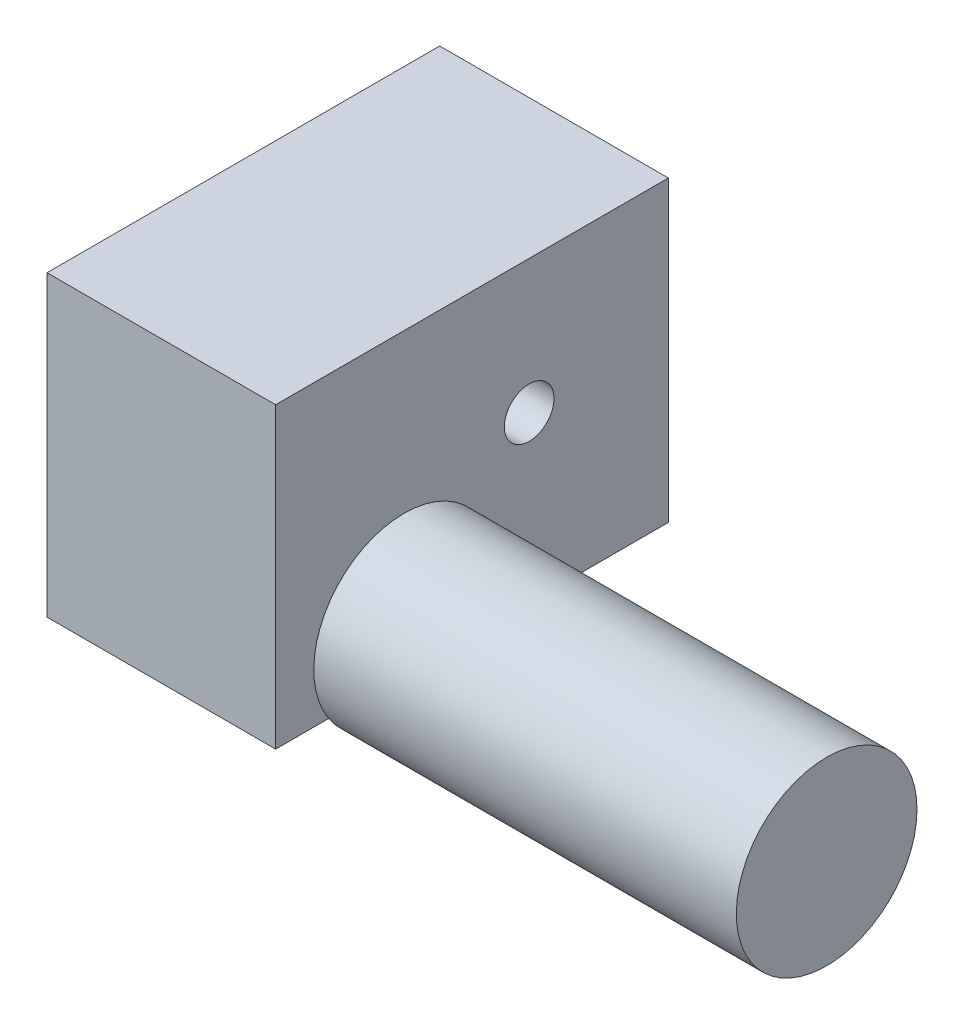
ISO-10303-21;
HEADER;
FILE_DESCRIPTION(('STEP AP214'),'2;1');
FILE_NAME('part.step','',(''),(''),'','','');
FILE_SCHEMA(('AUTOMOTIVE_DESIGN { 1 0 10303 214 1 1 1 1 }'));
ENDSEC;
DATA;
#1=APPLICATION_CONTEXT('core data for automotive mechanical design processes');
#2=APPLICATION_PROTOCOL_DEFINITION('international standard','automotive_design',2000,#1);
#3=PRODUCT_CONTEXT('',#1,'mechanical');
#4=PRODUCT('Part','Part','',(#3));
#5=PRODUCT_RELATED_PRODUCT_CATEGORY('part','',(#4));
#6=PRODUCT_DEFINITION_FORMATION('','',#4);
#7=PRODUCT_DEFINITION_CONTEXT('part definition',#1,'design');
#8=PRODUCT_DEFINITION('design','',#6,#7);
#9=PRODUCT_DEFINITION_SHAPE('','',#8);
#10=(LENGTH_UNIT() NAMED_UNIT(*) SI_UNIT(.MILLI.,.METRE.));
#11=(NAMED_UNIT(*) PLANE_ANGLE_UNIT() SI_UNIT($,.RADIAN.));
#12=(NAMED_UNIT(*) SI_UNIT($,.STERADIAN.) SOLID_ANGLE_UNIT());
#13=UNCERTAINTY_MEASURE_WITH_UNIT(LENGTH_MEASURE(1.E-05),#10,'distance_accuracy_value','');
#14=(GEOMETRIC_REPRESENTATION_CONTEXT(3) GLOBAL_UNCERTAINTY_ASSIGNED_CONTEXT((#13)) GLOBAL_UNIT_ASSIGNED_CONTEXT((#10,
#11,#12)) REPRESENTATION_CONTEXT('',''));
#15=CARTESIAN_POINT('',(0.,0.,0.));
#16=DIRECTION('',(0.,0.,1.));
#17=DIRECTION('',(1.,0.,0.));
#18=AXIS2_PLACEMENT_3D('',#15,#16,#17);
#19=CARTESIAN_POINT('',(92.,0.,-158.));
#20=DIRECTION('',(0.,0.,1.));
#21=DIRECTION('',(1.,0.,0.));
#22=AXIS2_PLACEMENT_3D('',#19,#20,#21);
#23=PLANE('',#22);
#24=DIRECTION('',(-1.,0.,0.));
#25=VECTOR('',#24,1.);
#26=CARTESIAN_POINT('',(92.,0.,-158.));
#27=LINE('',#26,#25);
#28=CARTESIAN_POINT('',(92.,0.,-158.));
#29=VERTEX_POINT('',#28);
#30=CARTESIAN_POINT('',(0.,0.,-158.));
#31=VERTEX_POINT('',#30);
#32=EDGE_CURVE('E60',#29,#31,#27,.T.);
#33=ORIENTED_EDGE('',*,*,#32,.F.);
#34=DIRECTION('',(0.,1.,0.));
#35=VECTOR('',#34,1.);
#36=CARTESIAN_POINT('',(92.,0.,-158.));
#37=LINE('',#36,#35);
#38=CARTESIAN_POINT('',(92.,-120.,-158.));
#39=VERTEX_POINT('',#38);
#40=EDGE_CURVE('E110',#39,#29,#37,.T.);
#41=ORIENTED_EDGE('',*,*,#40,.F.);
#42=DIRECTION('',(-1.,0.,0.));
#43=VECTOR('',#42,1.);
#44=CARTESIAN_POINT('',(92.,-120.,-158.));
#45=LINE('',#44,#43);
#46=CARTESIAN_POINT('',(0.,-120.,-158.));
#47=VERTEX_POINT('',#46);
#48=EDGE_CURVE('E121',#39,#47,#45,.T.);
#49=ORIENTED_EDGE('',*,*,#48,.T.);
#50=DIRECTION('',(0.,1.,0.));
#51=VECTOR('',#50,1.);
#52=CARTESIAN_POINT('',(0.,0.,-158.));
#53=LINE('',#52,#51);
#54=EDGE_CURVE('E111',#47,#31,#53,.T.);
#55=ORIENTED_EDGE('',*,*,#54,.T.);
#56=EDGE_LOOP('',(#33,#41,#49,#55));
#57=FACE_BOUND('',#56,.T.);
#58=ADVANCED_FACE('F46',(#57),#23,.F.);
#59=CARTESIAN_POINT('',(92.,0.,0.));
#60=DIRECTION('',(0.,0.,-1.));
#61=DIRECTION('',(-1.,0.,0.));
#62=AXIS2_PLACEMENT_3D('',#59,#60,#61);
#63=PLANE('',#62);
#64=DIRECTION('',(1.,0.,0.));
#65=VECTOR('',#64,1.);
#66=CARTESIAN_POINT('',(92.,0.,0.));
#67=LINE('',#66,#65);
#68=CARTESIAN_POINT('',(0.,0.,0.));
#69=VERTEX_POINT('',#68);
#70=CARTESIAN_POINT('',(92.,0.,0.));
#71=VERTEX_POINT('',#70);
#72=EDGE_CURVE('E91',#69,#71,#67,.T.);
#73=ORIENTED_EDGE('',*,*,#72,.F.);
#74=DIRECTION('',(0.,-1.,0.));
#75=VECTOR('',#74,1.);
#76=CARTESIAN_POINT('',(0.,0.,0.));
#77=LINE('',#76,#75);
#78=CARTESIAN_POINT('',(0.,-120.,0.));
#79=VERTEX_POINT('',#78);
#80=EDGE_CURVE('E100',#69,#79,#77,.T.);
#81=ORIENTED_EDGE('',*,*,#80,.T.);
#82=DIRECTION('',(-1.,0.,0.));
#83=VECTOR('',#82,1.);
#84=CARTESIAN_POINT('',(92.,-120.,0.));
#85=LINE('',#84,#83);
#86=CARTESIAN_POINT('',(92.,-120.,0.));
#87=VERTEX_POINT('',#86);
#88=EDGE_CURVE('E125',#87,#79,#85,.T.);
#89=ORIENTED_EDGE('',*,*,#88,.F.);
#90=DIRECTION('',(0.,-1.,0.));
#91=VECTOR('',#90,1.);
#92=CARTESIAN_POINT('',(92.,0.,0.));
#93=LINE('',#92,#91);
#94=EDGE_CURVE('E54',#71,#87,#93,.T.);
#95=ORIENTED_EDGE('',*,*,#94,.F.);
#96=EDGE_LOOP('',(#73,#81,#89,#95));
#97=FACE_BOUND('',#96,.T.);
#98=ADVANCED_FACE('F98',(#97),#63,.F.);
#99=CARTESIAN_POINT('',(92.,0.,0.));
#100=DIRECTION('',(1.,0.,0.));
#101=DIRECTION('',(0.,0.,-1.));
#102=AXIS2_PLACEMENT_3D('',#99,#100,#101);
#103=PLANE('',#102);
#104=CARTESIAN_POINT('',(92.,-53.75,-102.));
#105=DIRECTION('',(1.,0.,0.));
#106=DIRECTION('',(0.,0.,-1.));
#107=AXIS2_PLACEMENT_3D('',#104,#105,#106);
#108=CIRCLE('',#107,10.);
#109=CARTESIAN_POINT('',(92.,-53.75,-112.));
#110=VERTEX_POINT('',#109);
#111=EDGE_CURVE('E147',#110,#110,#108,.T.);
#112=ORIENTED_EDGE('',*,*,#111,.F.);
#113=EDGE_LOOP('',(#112));
#114=FACE_BOUND('',#113,.T.);
#115=ORIENTED_EDGE('',*,*,#40,.T.);
#116=DIRECTION('',(0.,0.,1.));
#117=VECTOR('',#116,1.);
#118=CARTESIAN_POINT('',(92.,0.,0.));
#119=LINE('',#118,#117);
#120=EDGE_CURVE('E139',#29,#71,#119,.T.);
#121=ORIENTED_EDGE('',*,*,#120,.T.);
#122=ORIENTED_EDGE('',*,*,#94,.T.);
#123=DIRECTION('',(0.,0.,1.));
#124=VECTOR('',#123,1.);
#125=CARTESIAN_POINT('',(92.,-120.,0.));
#126=LINE('',#125,#124);
#127=CARTESIAN_POINT('',(92.,-120.,-21.3300016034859));
#128=VERTEX_POINT('',#127);
#129=EDGE_CURVE('E131',#128,#87,#126,.T.);
#130=ORIENTED_EDGE('',*,*,#129,.F.);
#131=CARTESIAN_POINT('',(92.,-100.009940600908,-51.6898439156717));
#132=DIRECTION('',(-1.,0.,0.));
#133=DIRECTION('',(0.,0.,-1.));
#134=AXIS2_PLACEMENT_3D('',#131,#132,#133);
#135=CIRCLE('',#134,36.35);
#136=CARTESIAN_POINT('',(92.,-120.,-82.0496862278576));
#137=VERTEX_POINT('',#136);
#138=EDGE_CURVE('E116',#128,#137,#135,.T.);
#139=ORIENTED_EDGE('',*,*,#138,.T.);
#140=EDGE_CURVE('E128',#39,#137,#126,.T.);
#141=ORIENTED_EDGE('',*,*,#140,.F.);
#142=EDGE_LOOP('',(#115,#121,#122,#130,#139,#141));
#143=FACE_BOUND('',#142,.T.);
#144=ADVANCED_FACE('F162',(#114,#143),#103,.T.);
#145=CARTESIAN_POINT('',(0.,0.,0.));
#146=DIRECTION('',(1.,0.,0.));
#147=DIRECTION('',(0.,0.,-1.));
#148=AXIS2_PLACEMENT_3D('',#145,#146,#147);
#149=PLANE('',#148);
#150=CARTESIAN_POINT('',(0.,-53.75,-102.));
#151=DIRECTION('',(1.,0.,0.));
#152=DIRECTION('',(0.,0.,-1.));
#153=AXIS2_PLACEMENT_3D('',#150,#151,#152);
#154=CIRCLE('',#153,10.);
#155=CARTESIAN_POINT('',(0.,-53.75,-112.));
#156=VERTEX_POINT('',#155);
#157=EDGE_CURVE('E103',#156,#156,#154,.T.);
#158=ORIENTED_EDGE('',*,*,#157,.T.);
#159=EDGE_LOOP('',(#158));
#160=FACE_BOUND('',#159,.T.);
#161=DIRECTION('',(0.,0.,1.));
#162=VECTOR('',#161,1.);
#163=CARTESIAN_POINT('',(0.,0.,0.));
#164=LINE('',#163,#162);
#165=EDGE_CURVE('E11',#31,#69,#164,.T.);
#166=ORIENTED_EDGE('',*,*,#165,.F.);
#167=ORIENTED_EDGE('',*,*,#54,.F.);
#168=DIRECTION('',(0.,0.,1.));
#169=VECTOR('',#168,1.);
#170=CARTESIAN_POINT('',(0.,-120.,0.));
#171=LINE('',#170,#169);
#172=EDGE_CURVE('E108',#47,#79,#171,.T.);
#173=ORIENTED_EDGE('',*,*,#172,.T.);
#174=ORIENTED_EDGE('',*,*,#80,.F.);
#175=EDGE_LOOP('',(#166,#167,#173,#174));
#176=FACE_BOUND('',#175,.T.);
#177=ADVANCED_FACE('F106',(#160,#176),#149,.F.);
#178=CARTESIAN_POINT('',(92.,-120.,0.));
#179=DIRECTION('',(0.,1.,0.));
#180=DIRECTION('',(0.,0.,-1.));
#181=AXIS2_PLACEMENT_3D('',#178,#179,#180);
#182=PLANE('',#181);
#183=ORIENTED_EDGE('',*,*,#172,.F.);
#184=ORIENTED_EDGE('',*,*,#48,.F.);
#185=ORIENTED_EDGE('',*,*,#140,.T.);
#186=EDGE_CURVE('E136',#137,#128,#126,.T.);
#187=ORIENTED_EDGE('',*,*,#186,.T.);
#188=ORIENTED_EDGE('',*,*,#129,.T.);
#189=ORIENTED_EDGE('',*,*,#88,.T.);
#190=EDGE_LOOP('',(#183,#184,#185,#187,#188,#189));
#191=FACE_BOUND('',#190,.T.);
#192=ADVANCED_FACE('F171',(#191),#182,.F.);
#193=CARTESIAN_POINT('',(92.,-100.009940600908,-51.6898439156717));
#194=DIRECTION('',(1.,0.,0.));
#195=DIRECTION('',(0.,0.,-1.));
#196=AXIS2_PLACEMENT_3D('',#193,#194,#195);
#197=PLANE('',#196);
#198=EDGE_CURVE('E67',#137,#128,#135,.T.);
#199=ORIENTED_EDGE('',*,*,#198,.T.);
#200=ORIENTED_EDGE('',*,*,#186,.F.);
#201=EDGE_LOOP('',(#199,#200));
#202=FACE_BOUND('',#201,.T.);
#203=ADVANCED_FACE('F179',(#202),#197,.F.);
#204=CARTESIAN_POINT('',(262.,-100.009940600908,-51.6898439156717));
#205=DIRECTION('',(-1.,0.,0.));
#206=DIRECTION('',(0.,0.,1.));
#207=AXIS2_PLACEMENT_3D('',#204,#205,#206);
#208=CYLINDRICAL_SURFACE('',#207,36.35);
#209=CARTESIAN_POINT('',(262.,-100.009940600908,-51.6898439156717));
#210=DIRECTION('',(-1.,0.,0.));
#211=DIRECTION('',(0.,0.,-1.));
#212=AXIS2_PLACEMENT_3D('',#209,#210,#211);
#213=CIRCLE('',#212,36.35);
#214=CARTESIAN_POINT('',(262.,-100.009940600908,-88.0398439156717));
#215=VERTEX_POINT('',#214);
#216=EDGE_CURVE('E132',#215,#215,#213,.T.);
#217=ORIENTED_EDGE('',*,*,#216,.T.);
#218=EDGE_LOOP('',(#217));
#219=FACE_BOUND('',#218,.T.);
#220=ORIENTED_EDGE('',*,*,#198,.F.);
#221=ORIENTED_EDGE('',*,*,#138,.F.);
#222=EDGE_LOOP('',(#220,#221));
#223=FACE_BOUND('',#222,.T.);
#224=ADVANCED_FACE('F181',(#219,#223),#208,.T.);
#225=CARTESIAN_POINT('',(262.,-100.009940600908,-51.6898439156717));
#226=DIRECTION('',(1.,0.,0.));
#227=DIRECTION('',(0.,0.,-1.));
#228=AXIS2_PLACEMENT_3D('',#225,#226,#227);
#229=PLANE('',#228);
#230=ORIENTED_EDGE('',*,*,#216,.F.);
#231=EDGE_LOOP('',(#230));
#232=FACE_BOUND('',#231,.T.);
#233=ADVANCED_FACE('F187',(#232),#229,.T.);
#234=CARTESIAN_POINT('',(0.,0.,0.));
#235=DIRECTION('',(0.,1.,0.));
#236=DIRECTION('',(0.,0.,1.));
#237=AXIS2_PLACEMENT_3D('',#234,#235,#236);
#238=PLANE('',#237);
#239=ORIENTED_EDGE('',*,*,#32,.T.);
#240=ORIENTED_EDGE('',*,*,#165,.T.);
#241=ORIENTED_EDGE('',*,*,#72,.T.);
#242=ORIENTED_EDGE('',*,*,#120,.F.);
#243=EDGE_LOOP('',(#239,#240,#241,#242));
#244=FACE_BOUND('',#243,.T.);
#245=ADVANCED_FACE('F90',(#244),#238,.T.);
#246=CARTESIAN_POINT('',(0.,-53.75,-102.));
#247=DIRECTION('',(1.,0.,0.));
#248=DIRECTION('',(0.,0.,-1.));
#249=AXIS2_PLACEMENT_3D('',#246,#247,#248);
#250=CYLINDRICAL_SURFACE('',#249,10.);
#251=ORIENTED_EDGE('',*,*,#157,.F.);
#252=EDGE_LOOP('',(#251));
#253=FACE_BOUND('',#252,.T.);
#254=ORIENTED_EDGE('',*,*,#111,.T.);
#255=EDGE_LOOP('',(#254));
#256=FACE_BOUND('',#255,.T.);
#257=ADVANCED_FACE('F156',(#253,#256),#250,.F.);
#258=CLOSED_SHELL('',(#58,#98,#144,#177,#192,#203,#224,#233,#245,#257));
#259=MANIFOLD_SOLID_BREP('B2',#258);
#260=ADVANCED_BREP_SHAPE_REPRESENTATION('',(#18,#259),#14);
#261=SHAPE_DEFINITION_REPRESENTATION(#9,#260);
ENDSEC;
END-ISO-10303-21;
